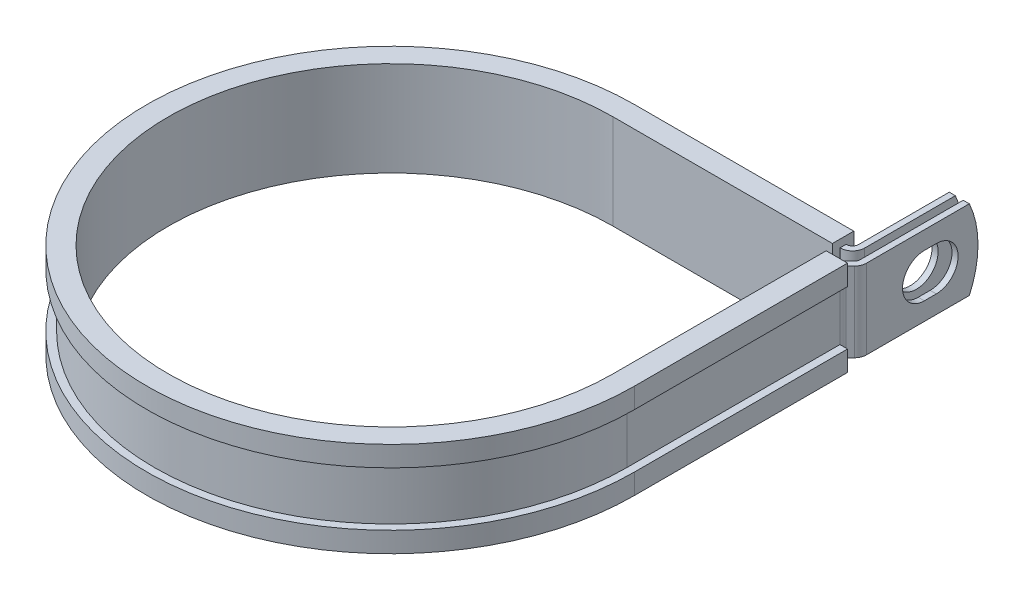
ISO-10303-21;
HEADER;
FILE_DESCRIPTION(('STEP AP214'),'2;1');
FILE_NAME('part.step','',(''),(''),'','','');
FILE_SCHEMA(('AUTOMOTIVE_DESIGN { 1 0 10303 214 1 1 1 1 }'));
ENDSEC;
DATA;
#1=APPLICATION_CONTEXT('core data for automotive mechanical design processes');
#2=APPLICATION_PROTOCOL_DEFINITION('international standard','automotive_design',2000,#1);
#3=PRODUCT_CONTEXT('',#1,'mechanical');
#4=PRODUCT('Part','Part','',(#3));
#5=PRODUCT_RELATED_PRODUCT_CATEGORY('part','',(#4));
#6=PRODUCT_DEFINITION_FORMATION('','',#4);
#7=PRODUCT_DEFINITION_CONTEXT('part definition',#1,'design');
#8=PRODUCT_DEFINITION('design','',#6,#7);
#9=PRODUCT_DEFINITION_SHAPE('','',#8);
#10=(LENGTH_UNIT() NAMED_UNIT(*) SI_UNIT(.MILLI.,.METRE.));
#11=(NAMED_UNIT(*) PLANE_ANGLE_UNIT() SI_UNIT($,.RADIAN.));
#12=(NAMED_UNIT(*) SI_UNIT($,.STERADIAN.) SOLID_ANGLE_UNIT());
#13=UNCERTAINTY_MEASURE_WITH_UNIT(LENGTH_MEASURE(1.E-05),#10,'distance_accuracy_value','');
#14=(GEOMETRIC_REPRESENTATION_CONTEXT(3) GLOBAL_UNCERTAINTY_ASSIGNED_CONTEXT((#13)) GLOBAL_UNIT_ASSIGNED_CONTEXT((#10,
#11,#12)) REPRESENTATION_CONTEXT('',''));
#15=CARTESIAN_POINT('',(0.,0.,0.));
#16=DIRECTION('',(0.,0.,1.));
#17=DIRECTION('',(1.,0.,0.));
#18=AXIS2_PLACEMENT_3D('',#15,#16,#17);
#19=CARTESIAN_POINT('',(46.6522698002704,-7.9375,-45.974));
#20=DIRECTION('',(0.,1.,0.));
#21=DIRECTION('',(1.,0.,0.));
#22=AXIS2_PLACEMENT_3D('',#19,#20,#21);
#23=PLANE('',#22);
#24=DIRECTION('',(0.,0.,-1.));
#25=VECTOR('',#24,1.);
#26=CARTESIAN_POINT('',(43.8074698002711,-7.9375,-45.974));
#27=LINE('',#26,#25);
#28=CARTESIAN_POINT('',(43.8074698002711,-7.9375,-45.974));
#29=VERTEX_POINT('',#28);
#30=CARTESIAN_POINT('',(43.8074698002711,-7.9375,-47.1932));
#31=VERTEX_POINT('',#30);
#32=EDGE_CURVE('E524',#29,#31,#27,.T.);
#33=ORIENTED_EDGE('',*,*,#32,.T.);
#34=DIRECTION('',(1.,0.,0.));
#35=VECTOR('',#34,1.);
#36=CARTESIAN_POINT('',(0.,-7.9375,-47.1932));
#37=LINE('',#36,#35);
#38=CARTESIAN_POINT('',(43.8582698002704,-7.9375,-47.1932));
#39=VERTEX_POINT('',#38);
#40=EDGE_CURVE('E411',#39,#31,#37,.F.);
#41=ORIENTED_EDGE('',*,*,#40,.F.);
#42=CARTESIAN_POINT('',(43.8582698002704,-7.9375,-48.4124));
#43=DIRECTION('',(0.,1.,0.));
#44=DIRECTION('',(1.,0.,0.));
#45=AXIS2_PLACEMENT_3D('',#42,#43,#44);
#46=CIRCLE('',#45,1.2192);
#47=CARTESIAN_POINT('',(45.0774698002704,-7.9375,-48.4124));
#48=VERTEX_POINT('',#47);
#49=EDGE_CURVE('E409',#48,#39,#46,.F.);
#50=ORIENTED_EDGE('',*,*,#49,.F.);
#51=DIRECTION('',(0.,0.,1.));
#52=VECTOR('',#51,1.);
#53=CARTESIAN_POINT('',(45.0774698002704,-7.9375,-68.2498));
#54=LINE('',#53,#52);
#55=CARTESIAN_POINT('',(45.0774698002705,-7.9375,-66.5173804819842));
#56=VERTEX_POINT('',#55);
#57=EDGE_CURVE('E407',#56,#48,#54,.T.);
#58=ORIENTED_EDGE('',*,*,#57,.F.);
#59=DIRECTION('',(-1.,0.,0.));
#60=VECTOR('',#59,1.);
#61=CARTESIAN_POINT('',(49.0906698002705,-7.9375,-66.5173804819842));
#62=LINE('',#61,#60);
#63=CARTESIAN_POINT('',(46.2966698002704,-7.9375,-66.5173804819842));
#64=VERTEX_POINT('',#63);
#65=EDGE_CURVE('E12',#64,#56,#62,.T.);
#66=ORIENTED_EDGE('',*,*,#65,.F.);
#67=DIRECTION('',(0.,0.,1.));
#68=VECTOR('',#67,1.);
#69=CARTESIAN_POINT('',(46.2966698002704,-7.9375,-68.2498));
#70=LINE('',#69,#68);
#71=CARTESIAN_POINT('',(46.2966698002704,-7.9375,-48.4124));
#72=VERTEX_POINT('',#71);
#73=EDGE_CURVE('E405',#64,#72,#70,.T.);
#74=ORIENTED_EDGE('',*,*,#73,.T.);
#75=CARTESIAN_POINT('',(43.8582698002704,-7.9375,-48.4124));
#76=DIRECTION('',(0.,-1.,0.));
#77=DIRECTION('',(0.,0.,1.));
#78=AXIS2_PLACEMENT_3D('',#75,#76,#77);
#79=CIRCLE('',#78,2.4384);
#80=CARTESIAN_POINT('',(43.8582698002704,-7.9375,-45.974));
#81=VERTEX_POINT('',#80);
#82=EDGE_CURVE('E402',#72,#81,#79,.T.);
#83=ORIENTED_EDGE('',*,*,#82,.T.);
#84=DIRECTION('',(-1.,0.,0.));
#85=VECTOR('',#84,1.);
#86=CARTESIAN_POINT('',(0.,-7.9375,-45.974));
#87=LINE('',#86,#85);
#88=EDGE_CURVE('E399',#81,#29,#87,.T.);
#89=ORIENTED_EDGE('',*,*,#88,.T.);
#90=EDGE_LOOP('',(#33,#41,#50,#58,#66,#74,#83,#89));
#91=FACE_BOUND('',#90,.T.);
#92=ADVANCED_FACE('F55',(#91),#23,.F.);
#93=CARTESIAN_POINT('',(46.6522698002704,7.9375,-45.974));
#94=DIRECTION('',(0.,1.,0.));
#95=DIRECTION('',(1.,0.,0.));
#96=AXIS2_PLACEMENT_3D('',#93,#94,#95);
#97=PLANE('',#96);
#98=DIRECTION('',(1.,0.,0.));
#99=VECTOR('',#98,1.);
#100=CARTESIAN_POINT('',(0.,7.9375,-47.1932));
#101=LINE('',#100,#99);
#102=CARTESIAN_POINT('',(43.8582698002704,7.9375,-47.1932));
#103=VERTEX_POINT('',#102);
#104=CARTESIAN_POINT('',(43.8074698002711,7.9375,-47.1932));
#105=VERTEX_POINT('',#104);
#106=EDGE_CURVE('E369',#103,#105,#101,.F.);
#107=ORIENTED_EDGE('',*,*,#106,.T.);
#108=DIRECTION('',(0.,0.,1.));
#109=VECTOR('',#108,1.);
#110=CARTESIAN_POINT('',(43.8074698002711,7.9375,-47.1932));
#111=LINE('',#110,#109);
#112=CARTESIAN_POINT('',(43.8074698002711,7.9375,-45.974));
#113=VERTEX_POINT('',#112);
#114=EDGE_CURVE('E518',#105,#113,#111,.T.);
#115=ORIENTED_EDGE('',*,*,#114,.T.);
#116=DIRECTION('',(-1.,0.,0.));
#117=VECTOR('',#116,1.);
#118=CARTESIAN_POINT('',(0.,7.9375,-45.974));
#119=LINE('',#118,#117);
#120=CARTESIAN_POINT('',(43.8582698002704,7.9375,-45.974));
#121=VERTEX_POINT('',#120);
#122=EDGE_CURVE('E626',#121,#113,#119,.T.);
#123=ORIENTED_EDGE('',*,*,#122,.F.);
#124=CARTESIAN_POINT('',(43.8582698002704,7.9375,-48.4124));
#125=DIRECTION('',(0.,-1.,0.));
#126=DIRECTION('',(0.,0.,1.));
#127=AXIS2_PLACEMENT_3D('',#124,#125,#126);
#128=CIRCLE('',#127,2.4384);
#129=CARTESIAN_POINT('',(46.2966698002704,7.9375,-48.4124));
#130=VERTEX_POINT('',#129);
#131=EDGE_CURVE('E371',#130,#121,#128,.T.);
#132=ORIENTED_EDGE('',*,*,#131,.F.);
#133=DIRECTION('',(0.,0.,1.));
#134=VECTOR('',#133,1.);
#135=CARTESIAN_POINT('',(46.2966698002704,7.9375,-68.2498));
#136=LINE('',#135,#134);
#137=CARTESIAN_POINT('',(46.2966698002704,7.9375,-66.5173804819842));
#138=VERTEX_POINT('',#137);
#139=EDGE_CURVE('E362',#138,#130,#136,.T.);
#140=ORIENTED_EDGE('',*,*,#139,.F.);
#141=DIRECTION('',(-1.,0.,0.));
#142=VECTOR('',#141,1.);
#143=CARTESIAN_POINT('',(49.0906698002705,7.9375,-66.5173804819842));
#144=LINE('',#143,#142);
#145=CARTESIAN_POINT('',(45.0774698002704,7.9375,-66.5173804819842));
#146=VERTEX_POINT('',#145);
#147=EDGE_CURVE('E63',#138,#146,#144,.T.);
#148=ORIENTED_EDGE('',*,*,#147,.T.);
#149=DIRECTION('',(0.,0.,1.));
#150=VECTOR('',#149,1.);
#151=CARTESIAN_POINT('',(45.0774698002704,7.9375,-68.2498));
#152=LINE('',#151,#150);
#153=CARTESIAN_POINT('',(45.0774698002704,7.9375,-48.4124));
#154=VERTEX_POINT('',#153);
#155=EDGE_CURVE('E359',#146,#154,#152,.T.);
#156=ORIENTED_EDGE('',*,*,#155,.T.);
#157=CARTESIAN_POINT('',(43.8582698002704,7.9375,-48.4124));
#158=DIRECTION('',(0.,1.,0.));
#159=DIRECTION('',(1.,0.,0.));
#160=AXIS2_PLACEMENT_3D('',#157,#158,#159);
#161=CIRCLE('',#160,1.2192);
#162=EDGE_CURVE('E367',#154,#103,#161,.F.);
#163=ORIENTED_EDGE('',*,*,#162,.T.);
#164=EDGE_LOOP('',(#107,#115,#123,#132,#140,#148,#156,#163));
#165=FACE_BOUND('',#164,.T.);
#166=ADVANCED_FACE('F358',(#165),#97,.T.);
#167=CARTESIAN_POINT('',(0.,7.9375,-45.974));
#168=DIRECTION('',(0.,0.,1.));
#169=DIRECTION('',(1.,0.,0.));
#170=AXIS2_PLACEMENT_3D('',#167,#168,#169);
#171=PLANE('',#170);
#172=ORIENTED_EDGE('',*,*,#122,.T.);
#173=DIRECTION('',(0.,-1.,0.));
#174=VECTOR('',#173,1.);
#175=CARTESIAN_POINT('',(43.8074698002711,7.9375,-45.974));
#176=LINE('',#175,#174);
#177=EDGE_CURVE('E521',#113,#29,#176,.T.);
#178=ORIENTED_EDGE('',*,*,#177,.T.);
#179=ORIENTED_EDGE('',*,*,#88,.F.);
#180=DIRECTION('',(0.,-1.,0.));
#181=VECTOR('',#180,1.);
#182=CARTESIAN_POINT('',(43.8582698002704,7.9375,-45.974));
#183=LINE('',#182,#181);
#184=EDGE_CURVE('E345',#121,#81,#183,.T.);
#185=ORIENTED_EDGE('',*,*,#184,.F.);
#186=EDGE_LOOP('',(#172,#178,#179,#185));
#187=FACE_BOUND('',#186,.T.);
#188=ADVANCED_FACE('F636',(#187),#171,.T.);
#189=CARTESIAN_POINT('',(49.0906698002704,7.9375,-45.974));
#190=DIRECTION('',(-1.,0.,0.));
#191=DIRECTION('',(0.,0.,1.));
#192=AXIS2_PLACEMENT_3D('',#189,#190,#191);
#193=PLANE('',#192);
#194=CARTESIAN_POINT('',(49.0906698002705,0.,-59.9185999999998));
#195=DIRECTION('',(1.,0.,0.));
#196=DIRECTION('',(0.,0.,-1.));
#197=AXIS2_PLACEMENT_3D('',#194,#195,#196);
#198=CIRCLE('',#197,4.3561);
#199=CARTESIAN_POINT('',(49.0906698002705,-4.3561,-59.9186000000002));
#200=VERTEX_POINT('',#199);
#201=CARTESIAN_POINT('',(49.0906698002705,4.3561,-59.9186000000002));
#202=VERTEX_POINT('',#201);
#203=EDGE_CURVE('E581',#200,#202,#198,.T.);
#204=ORIENTED_EDGE('',*,*,#203,.F.);
#205=DIRECTION('',(0.,0.,-1.));
#206=VECTOR('',#205,1.);
#207=CARTESIAN_POINT('',(49.0906698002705,-4.3561,-57.5309999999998));
#208=LINE('',#207,#206);
#209=CARTESIAN_POINT('',(49.0906698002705,-4.3561,-57.5309999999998));
#210=VERTEX_POINT('',#209);
#211=EDGE_CURVE('E584',#210,#200,#208,.T.);
#212=ORIENTED_EDGE('',*,*,#211,.F.);
#213=CARTESIAN_POINT('',(49.0906698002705,0.,-57.5309999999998));
#214=DIRECTION('',(1.,0.,0.));
#215=DIRECTION('',(0.,0.,-1.));
#216=AXIS2_PLACEMENT_3D('',#213,#214,#215);
#217=CIRCLE('',#216,4.3561);
#218=CARTESIAN_POINT('',(49.0906698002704,4.3561,-57.5309999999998));
#219=VERTEX_POINT('',#218);
#220=EDGE_CURVE('E577',#219,#210,#217,.T.);
#221=ORIENTED_EDGE('',*,*,#220,.F.);
#222=DIRECTION('',(0.,0.,1.));
#223=VECTOR('',#222,1.);
#224=CARTESIAN_POINT('',(49.0906698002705,4.3561,-57.5309999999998));
#225=LINE('',#224,#223);
#226=EDGE_CURVE('E578',#202,#219,#225,.T.);
#227=ORIENTED_EDGE('',*,*,#226,.F.);
#228=EDGE_LOOP('',(#204,#212,#221,#227));
#229=FACE_BOUND('',#228,.T.);
#230=DIRECTION('',(0.,0.,-1.));
#231=VECTOR('',#230,1.);
#232=CARTESIAN_POINT('',(49.0906698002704,-7.9375,-45.974));
#233=LINE('',#232,#231);
#234=CARTESIAN_POINT('',(49.0906698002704,-7.9375,-45.974));
#235=VERTEX_POINT('',#234);
#236=CARTESIAN_POINT('',(49.0906698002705,-7.9375,-66.5173804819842));
#237=VERTEX_POINT('',#236);
#238=EDGE_CURVE('E383',#235,#237,#233,.T.);
#239=ORIENTED_EDGE('',*,*,#238,.T.);
#240=CARTESIAN_POINT('',(49.0906698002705,0.,-49.1998));
#241=DIRECTION('',(-1.,0.,0.));
#242=DIRECTION('',(0.,0.,1.));
#243=AXIS2_PLACEMENT_3D('',#240,#241,#242);
#244=CIRCLE('',#243,19.05);
#245=CARTESIAN_POINT('',(49.0906698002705,7.9375,-66.5173804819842));
#246=VERTEX_POINT('',#245);
#247=EDGE_CURVE('E569',#246,#237,#244,.T.);
#248=ORIENTED_EDGE('',*,*,#247,.F.);
#249=DIRECTION('',(0.,0.,-1.));
#250=VECTOR('',#249,1.);
#251=CARTESIAN_POINT('',(49.0906698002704,7.9375,-45.974));
#252=LINE('',#251,#250);
#253=CARTESIAN_POINT('',(49.0906698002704,7.9375,-45.974));
#254=VERTEX_POINT('',#253);
#255=EDGE_CURVE('E420',#254,#246,#252,.T.);
#256=ORIENTED_EDGE('',*,*,#255,.F.);
#257=DIRECTION('',(0.,-1.,0.));
#258=VECTOR('',#257,1.);
#259=CARTESIAN_POINT('',(49.0906698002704,7.9375,-45.974));
#260=LINE('',#259,#258);
#261=EDGE_CURVE('E382',#254,#235,#260,.T.);
#262=ORIENTED_EDGE('',*,*,#261,.T.);
#263=EDGE_LOOP('',(#239,#248,#256,#262));
#264=FACE_BOUND('',#263,.T.);
#265=ADVANCED_FACE('F57',(#229,#264),#193,.F.);
#266=CARTESIAN_POINT('',(47.8714698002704,7.9375,-45.974));
#267=DIRECTION('',(-1.,0.,0.));
#268=DIRECTION('',(0.,0.,1.));
#269=AXIS2_PLACEMENT_3D('',#266,#267,#268);
#270=PLANE('',#269);
#271=DIRECTION('',(0.,0.,-1.));
#272=VECTOR('',#271,1.);
#273=CARTESIAN_POINT('',(47.8714698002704,-4.3561,-57.5309999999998));
#274=LINE('',#273,#272);
#275=CARTESIAN_POINT('',(47.8714698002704,-4.3561,-57.5309999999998));
#276=VERTEX_POINT('',#275);
#277=CARTESIAN_POINT('',(47.8714698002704,-4.3561,-59.9186000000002));
#278=VERTEX_POINT('',#277);
#279=EDGE_CURVE('E580',#276,#278,#274,.T.);
#280=ORIENTED_EDGE('',*,*,#279,.T.);
#281=CARTESIAN_POINT('',(47.8714698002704,0.,-59.9185999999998));
#282=DIRECTION('',(-1.,0.,0.));
#283=DIRECTION('',(0.,0.,1.));
#284=AXIS2_PLACEMENT_3D('',#281,#282,#283);
#285=CIRCLE('',#284,4.3561);
#286=CARTESIAN_POINT('',(47.8714698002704,4.3561,-59.9186000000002));
#287=VERTEX_POINT('',#286);
#288=EDGE_CURVE('E601',#278,#287,#285,.F.);
#289=ORIENTED_EDGE('',*,*,#288,.T.);
#290=DIRECTION('',(0.,0.,1.));
#291=VECTOR('',#290,1.);
#292=CARTESIAN_POINT('',(47.8714698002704,4.3561,-57.5309999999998));
#293=LINE('',#292,#291);
#294=CARTESIAN_POINT('',(47.8714698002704,4.3561,-57.5309999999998));
#295=VERTEX_POINT('',#294);
#296=EDGE_CURVE('E597',#287,#295,#293,.T.);
#297=ORIENTED_EDGE('',*,*,#296,.T.);
#298=CARTESIAN_POINT('',(47.8714698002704,0.,-57.5309999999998));
#299=DIRECTION('',(-1.,0.,0.));
#300=DIRECTION('',(0.,0.,1.));
#301=AXIS2_PLACEMENT_3D('',#298,#299,#300);
#302=CIRCLE('',#301,4.3561);
#303=EDGE_CURVE('E592',#295,#276,#302,.F.);
#304=ORIENTED_EDGE('',*,*,#303,.T.);
#305=EDGE_LOOP('',(#280,#289,#297,#304));
#306=FACE_BOUND('',#305,.T.);
#307=CARTESIAN_POINT('',(47.8714698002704,0.,-49.1998));
#308=DIRECTION('',(-1.,0.,0.));
#309=DIRECTION('',(0.,0.,1.));
#310=AXIS2_PLACEMENT_3D('',#307,#308,#309);
#311=CIRCLE('',#310,19.05);
#312=CARTESIAN_POINT('',(47.8714698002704,7.9375,-66.5173804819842));
#313=VERTEX_POINT('',#312);
#314=CARTESIAN_POINT('',(47.8714698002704,-7.9375,-66.5173804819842));
#315=VERTEX_POINT('',#314);
#316=EDGE_CURVE('E77',#313,#315,#311,.T.);
#317=ORIENTED_EDGE('',*,*,#316,.T.);
#318=DIRECTION('',(0.,0.,-1.));
#319=VECTOR('',#318,1.);
#320=CARTESIAN_POINT('',(47.8714698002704,-7.9375,-45.974));
#321=LINE('',#320,#319);
#322=CARTESIAN_POINT('',(47.8714698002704,-7.9375,-45.974));
#323=VERTEX_POINT('',#322);
#324=EDGE_CURVE('E386',#323,#315,#321,.T.);
#325=ORIENTED_EDGE('',*,*,#324,.F.);
#326=DIRECTION('',(0.,-1.,0.));
#327=VECTOR('',#326,1.);
#328=CARTESIAN_POINT('',(47.8714698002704,7.9375,-45.974));
#329=LINE('',#328,#327);
#330=CARTESIAN_POINT('',(47.8714698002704,7.9375,-45.974));
#331=VERTEX_POINT('',#330);
#332=EDGE_CURVE('E353',#331,#323,#329,.T.);
#333=ORIENTED_EDGE('',*,*,#332,.F.);
#334=DIRECTION('',(0.,0.,-1.));
#335=VECTOR('',#334,1.);
#336=CARTESIAN_POINT('',(47.8714698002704,7.9375,-45.974));
#337=LINE('',#336,#335);
#338=EDGE_CURVE('E616',#331,#313,#337,.T.);
#339=ORIENTED_EDGE('',*,*,#338,.T.);
#340=EDGE_LOOP('',(#317,#325,#333,#339));
#341=FACE_BOUND('',#340,.T.);
#342=ADVANCED_FACE('F690',(#306,#341),#270,.T.);
#343=CARTESIAN_POINT('',(46.2966698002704,7.9375,-68.2498));
#344=DIRECTION('',(1.,0.,0.));
#345=DIRECTION('',(0.,0.,-1.));
#346=AXIS2_PLACEMENT_3D('',#343,#344,#345);
#347=PLANE('',#346);
#348=CARTESIAN_POINT('',(46.2966698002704,0.,-58.7248));
#349=DIRECTION('',(1.,0.,0.));
#350=DIRECTION('',(0.,0.,-1.));
#351=AXIS2_PLACEMENT_3D('',#348,#349,#350);
#352=CIRCLE('',#351,4.3561);
#353=CARTESIAN_POINT('',(46.2966698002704,0.,-63.0809));
#354=VERTEX_POINT('',#353);
#355=EDGE_CURVE('E387',#354,#354,#352,.F.);
#356=ORIENTED_EDGE('',*,*,#355,.T.);
#357=EDGE_LOOP('',(#356));
#358=FACE_BOUND('',#357,.T.);
#359=ORIENTED_EDGE('',*,*,#73,.F.);
#360=CARTESIAN_POINT('',(46.2966698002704,0.,-49.1998));
#361=DIRECTION('',(1.,0.,0.));
#362=DIRECTION('',(0.,0.,-1.));
#363=AXIS2_PLACEMENT_3D('',#360,#361,#362);
#364=CIRCLE('',#363,19.05);
#365=EDGE_CURVE('E574',#64,#138,#364,.T.);
#366=ORIENTED_EDGE('',*,*,#365,.T.);
#367=ORIENTED_EDGE('',*,*,#139,.T.);
#368=DIRECTION('',(0.,-1.,0.));
#369=VECTOR('',#368,1.);
#370=CARTESIAN_POINT('',(46.2966698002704,7.9375,-48.4124));
#371=LINE('',#370,#369);
#372=EDGE_CURVE('E342',#130,#72,#371,.T.);
#373=ORIENTED_EDGE('',*,*,#372,.T.);
#374=EDGE_LOOP('',(#359,#366,#367,#373));
#375=FACE_BOUND('',#374,.T.);
#376=ADVANCED_FACE('F642',(#358,#375),#347,.T.);
#377=CARTESIAN_POINT('',(45.0774698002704,7.9375,-68.2498));
#378=DIRECTION('',(1.,0.,0.));
#379=DIRECTION('',(0.,0.,-1.));
#380=AXIS2_PLACEMENT_3D('',#377,#378,#379);
#381=PLANE('',#380);
#382=CARTESIAN_POINT('',(45.0774698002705,0.,-58.7248));
#383=DIRECTION('',(-1.,0.,0.));
#384=DIRECTION('',(0.,0.,1.));
#385=AXIS2_PLACEMENT_3D('',#382,#383,#384);
#386=CIRCLE('',#385,4.3561);
#387=CARTESIAN_POINT('',(45.0774698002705,0.,-54.3687));
#388=VERTEX_POINT('',#387);
#389=EDGE_CURVE('E609',#388,#388,#386,.T.);
#390=ORIENTED_EDGE('',*,*,#389,.F.);
#391=EDGE_LOOP('',(#390));
#392=FACE_BOUND('',#391,.T.);
#393=CARTESIAN_POINT('',(45.0774698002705,0.,-49.1998));
#394=DIRECTION('',(-1.,0.,0.));
#395=DIRECTION('',(0.,0.,1.));
#396=AXIS2_PLACEMENT_3D('',#393,#394,#395);
#397=CIRCLE('',#396,19.05);
#398=EDGE_CURVE('E69',#146,#56,#397,.T.);
#399=ORIENTED_EDGE('',*,*,#398,.T.);
#400=ORIENTED_EDGE('',*,*,#57,.T.);
#401=DIRECTION('',(0.,-1.,0.));
#402=VECTOR('',#401,1.);
#403=CARTESIAN_POINT('',(45.0774698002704,7.9375,-48.4124));
#404=LINE('',#403,#402);
#405=EDGE_CURVE('E339',#154,#48,#404,.T.);
#406=ORIENTED_EDGE('',*,*,#405,.F.);
#407=ORIENTED_EDGE('',*,*,#155,.F.);
#408=EDGE_LOOP('',(#399,#400,#406,#407));
#409=FACE_BOUND('',#408,.T.);
#410=ADVANCED_FACE('F365',(#392,#409),#381,.F.);
#411=CARTESIAN_POINT('',(48.4124,-7.9375,-42.5615026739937));
#412=DIRECTION('',(0.,1.,0.));
#413=DIRECTION('',(1.,0.,0.));
#414=AXIS2_PLACEMENT_3D('',#411,#412,#413);
#415=CIRCLE('',#414,1.2192);
#416=CARTESIAN_POINT('',(47.1932,-7.9375,-42.5615026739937));
#417=VERTEX_POINT('',#416);
#418=CARTESIAN_POINT('',(47.5502954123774,-7.9375,-43.4236072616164));
#419=VERTEX_POINT('',#418);
#420=EDGE_CURVE('E414',#417,#419,#415,.F.);
#421=ORIENTED_EDGE('',*,*,#420,.F.);
#422=DIRECTION('',(1.,0.,0.));
#423=VECTOR('',#422,1.);
#424=CARTESIAN_POINT('',(45.974,-7.9375,-42.5615026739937));
#425=LINE('',#424,#423);
#426=CARTESIAN_POINT('',(45.974,-7.9375,-42.5615026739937));
#427=VERTEX_POINT('',#426);
#428=EDGE_CURVE('E452',#427,#417,#425,.T.);
#429=ORIENTED_EDGE('',*,*,#428,.F.);
#430=CARTESIAN_POINT('',(48.4124,-7.9375,-42.5615026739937));
#431=DIRECTION('',(0.,-1.,0.));
#432=DIRECTION('',(0.,0.,1.));
#433=AXIS2_PLACEMENT_3D('',#430,#431,#432);
#434=CIRCLE('',#433,2.4384);
#435=CARTESIAN_POINT('',(46.6881908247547,-7.9375,-44.285711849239));
#436=VERTEX_POINT('',#435);
#437=EDGE_CURVE('E396',#427,#436,#434,.T.);
#438=ORIENTED_EDGE('',*,*,#437,.T.);
#439=DIRECTION('',(0.707106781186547,0.,-0.707106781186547));
#440=VECTOR('',#439,1.);
#441=CARTESIAN_POINT('',(46.6881908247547,-7.9375,-44.285711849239));
#442=LINE('',#441,#440);
#443=CARTESIAN_POINT('',(47.5143743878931,-7.9375,-45.1118954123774));
#444=VERTEX_POINT('',#443);
#445=EDGE_CURVE('E393',#436,#444,#442,.T.);
#446=ORIENTED_EDGE('',*,*,#445,.T.);
#447=CARTESIAN_POINT('',(46.6522698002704,-7.9375,-45.974));
#448=DIRECTION('',(0.,1.,0.));
#449=DIRECTION('',(0.,0.,1.));
#450=AXIS2_PLACEMENT_3D('',#447,#448,#449);
#451=CIRCLE('',#450,1.2192);
#452=EDGE_CURVE('E390',#444,#323,#451,.T.);
#453=ORIENTED_EDGE('',*,*,#452,.T.);
#454=ORIENTED_EDGE('',*,*,#324,.T.);
#455=DIRECTION('',(-1.,0.,0.));
#456=VECTOR('',#455,1.);
#457=CARTESIAN_POINT('',(49.0906698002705,-7.9375,-66.5173804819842));
#458=LINE('',#457,#456);
#459=EDGE_CURVE('E567',#237,#315,#458,.T.);
#460=ORIENTED_EDGE('',*,*,#459,.F.);
#461=ORIENTED_EDGE('',*,*,#238,.F.);
#462=CARTESIAN_POINT('',(46.6522698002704,-7.9375,-45.974));
#463=DIRECTION('',(0.,1.,0.));
#464=DIRECTION('',(1.,0.,0.));
#465=AXIS2_PLACEMENT_3D('',#462,#463,#464);
#466=CIRCLE('',#465,2.4384);
#467=CARTESIAN_POINT('',(48.3764789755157,-7.9375,-44.2497908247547));
#468=VERTEX_POINT('',#467);
#469=EDGE_CURVE('E418',#468,#235,#466,.T.);
#470=ORIENTED_EDGE('',*,*,#469,.F.);
#471=DIRECTION('',(0.707106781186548,0.,-0.707106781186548));
#472=VECTOR('',#471,1.);
#473=CARTESIAN_POINT('',(47.5502954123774,-7.9375,-43.4236072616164));
#474=LINE('',#473,#472);
#475=EDGE_CURVE('E416',#419,#468,#474,.T.);
#476=ORIENTED_EDGE('',*,*,#475,.F.);
#477=EDGE_LOOP('',(#421,#429,#438,#446,#453,#454,#460,#461,#470,#476));
#478=FACE_BOUND('',#477,.T.);
#479=ADVANCED_FACE('F676',(#478),#23,.F.);
#480=DIRECTION('',(-1.,0.,0.));
#481=VECTOR('',#480,1.);
#482=CARTESIAN_POINT('',(47.1932,7.9375,-42.5615026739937));
#483=LINE('',#482,#481);
#484=CARTESIAN_POINT('',(47.1932,7.9375,-42.5615026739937));
#485=VERTEX_POINT('',#484);
#486=CARTESIAN_POINT('',(45.974,7.9375,-42.5615026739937));
#487=VERTEX_POINT('',#486);
#488=EDGE_CURVE('E441',#485,#487,#483,.T.);
#489=ORIENTED_EDGE('',*,*,#488,.F.);
#490=CARTESIAN_POINT('',(48.4124,7.9375,-42.5615026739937));
#491=DIRECTION('',(0.,1.,0.));
#492=DIRECTION('',(1.,0.,0.));
#493=AXIS2_PLACEMENT_3D('',#490,#491,#492);
#494=CIRCLE('',#493,1.2192);
#495=CARTESIAN_POINT('',(47.5502954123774,7.9375,-43.4236072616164));
#496=VERTEX_POINT('',#495);
#497=EDGE_CURVE('E376',#485,#496,#494,.F.);
#498=ORIENTED_EDGE('',*,*,#497,.T.);
#499=DIRECTION('',(0.707106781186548,0.,-0.707106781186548));
#500=VECTOR('',#499,1.);
#501=CARTESIAN_POINT('',(47.5502954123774,7.9375,-43.4236072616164));
#502=LINE('',#501,#500);
#503=CARTESIAN_POINT('',(48.3764789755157,7.9375,-44.2497908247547));
#504=VERTEX_POINT('',#503);
#505=EDGE_CURVE('E378',#496,#504,#502,.T.);
#506=ORIENTED_EDGE('',*,*,#505,.T.);
#507=CARTESIAN_POINT('',(46.6522698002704,7.9375,-45.974));
#508=DIRECTION('',(0.,1.,0.));
#509=DIRECTION('',(1.,0.,0.));
#510=AXIS2_PLACEMENT_3D('',#507,#508,#509);
#511=CIRCLE('',#510,2.4384);
#512=EDGE_CURVE('E380',#504,#254,#511,.T.);
#513=ORIENTED_EDGE('',*,*,#512,.T.);
#514=ORIENTED_EDGE('',*,*,#255,.T.);
#515=DIRECTION('',(-1.,0.,0.));
#516=VECTOR('',#515,1.);
#517=CARTESIAN_POINT('',(49.0906698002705,7.9375,-66.5173804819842));
#518=LINE('',#517,#516);
#519=EDGE_CURVE('E571',#246,#313,#518,.T.);
#520=ORIENTED_EDGE('',*,*,#519,.T.);
#521=ORIENTED_EDGE('',*,*,#338,.F.);
#522=CARTESIAN_POINT('',(46.6522698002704,7.9375,-45.974));
#523=DIRECTION('',(0.,1.,0.));
#524=DIRECTION('',(0.,0.,1.));
#525=AXIS2_PLACEMENT_3D('',#522,#523,#524);
#526=CIRCLE('',#525,1.2192);
#527=CARTESIAN_POINT('',(47.5143743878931,7.9375,-45.1118954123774));
#528=VERTEX_POINT('',#527);
#529=EDGE_CURVE('E619',#528,#331,#526,.T.);
#530=ORIENTED_EDGE('',*,*,#529,.F.);
#531=DIRECTION('',(0.707106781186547,0.,-0.707106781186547));
#532=VECTOR('',#531,1.);
#533=CARTESIAN_POINT('',(46.6881908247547,7.9375,-44.285711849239));
#534=LINE('',#533,#532);
#535=CARTESIAN_POINT('',(46.6881908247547,7.9375,-44.285711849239));
#536=VERTEX_POINT('',#535);
#537=EDGE_CURVE('E622',#536,#528,#534,.T.);
#538=ORIENTED_EDGE('',*,*,#537,.F.);
#539=CARTESIAN_POINT('',(48.4124,7.9375,-42.5615026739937));
#540=DIRECTION('',(0.,-1.,0.));
#541=DIRECTION('',(0.,0.,1.));
#542=AXIS2_PLACEMENT_3D('',#539,#540,#541);
#543=CIRCLE('',#542,2.4384);
#544=EDGE_CURVE('E451',#487,#536,#543,.T.);
#545=ORIENTED_EDGE('',*,*,#544,.F.);
#546=EDGE_LOOP('',(#489,#498,#506,#513,#514,#520,#521,#530,#538,#545));
#547=FACE_BOUND('',#546,.T.);
#548=ADVANCED_FACE('F448',(#547),#97,.T.);
#549=CARTESIAN_POINT('',(46.6522698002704,7.9375,-45.974));
#550=DIRECTION('',(0.,-1.,0.));
#551=DIRECTION('',(0.,0.,-1.));
#552=AXIS2_PLACEMENT_3D('',#549,#550,#551);
#553=CYLINDRICAL_SURFACE('',#552,1.2192);
#554=ORIENTED_EDGE('',*,*,#452,.F.);
#555=DIRECTION('',(0.,-1.,0.));
#556=VECTOR('',#555,1.);
#557=CARTESIAN_POINT('',(47.5143743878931,7.9375,-45.1118954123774));
#558=LINE('',#557,#556);
#559=EDGE_CURVE('E351',#528,#444,#558,.T.);
#560=ORIENTED_EDGE('',*,*,#559,.F.);
#561=ORIENTED_EDGE('',*,*,#529,.T.);
#562=ORIENTED_EDGE('',*,*,#332,.T.);
#563=EDGE_LOOP('',(#554,#560,#561,#562));
#564=FACE_BOUND('',#563,.T.);
#565=ADVANCED_FACE('F686',(#564),#553,.F.);
#566=CARTESIAN_POINT('',(46.6881908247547,7.9375,-44.285711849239));
#567=DIRECTION('',(-0.707106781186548,0.,-0.707106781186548));
#568=DIRECTION('',(-0.707106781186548,0.,0.707106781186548));
#569=AXIS2_PLACEMENT_3D('',#566,#567,#568);
#570=PLANE('',#569);
#571=ORIENTED_EDGE('',*,*,#445,.F.);
#572=DIRECTION('',(0.,-1.,0.));
#573=VECTOR('',#572,1.);
#574=CARTESIAN_POINT('',(46.6881908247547,7.9375,-44.285711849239));
#575=LINE('',#574,#573);
#576=EDGE_CURVE('E349',#536,#436,#575,.T.);
#577=ORIENTED_EDGE('',*,*,#576,.F.);
#578=ORIENTED_EDGE('',*,*,#537,.T.);
#579=ORIENTED_EDGE('',*,*,#559,.T.);
#580=EDGE_LOOP('',(#571,#577,#578,#579));
#581=FACE_BOUND('',#580,.T.);
#582=ADVANCED_FACE('F681',(#581),#570,.T.);
#583=CARTESIAN_POINT('',(48.4124,7.9375,-42.5615026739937));
#584=DIRECTION('',(0.,-1.,0.));
#585=DIRECTION('',(0.,0.,-1.));
#586=AXIS2_PLACEMENT_3D('',#583,#584,#585);
#587=CYLINDRICAL_SURFACE('',#586,2.4384);
#588=ORIENTED_EDGE('',*,*,#437,.F.);
#589=DIRECTION('',(0.,-1.,0.));
#590=VECTOR('',#589,1.);
#591=CARTESIAN_POINT('',(45.974,7.9375,-42.5615026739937));
#592=LINE('',#591,#590);
#593=EDGE_CURVE('E347',#487,#427,#592,.T.);
#594=ORIENTED_EDGE('',*,*,#593,.F.);
#595=ORIENTED_EDGE('',*,*,#544,.T.);
#596=ORIENTED_EDGE('',*,*,#576,.T.);
#597=EDGE_LOOP('',(#588,#594,#595,#596));
#598=FACE_BOUND('',#597,.T.);
#599=ADVANCED_FACE('F678',(#598),#587,.T.);
#600=CARTESIAN_POINT('',(43.8582698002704,7.9375,-48.4124));
#601=DIRECTION('',(0.,-1.,0.));
#602=DIRECTION('',(0.,0.,-1.));
#603=AXIS2_PLACEMENT_3D('',#600,#601,#602);
#604=CYLINDRICAL_SURFACE('',#603,2.4384);
#605=ORIENTED_EDGE('',*,*,#82,.F.);
#606=ORIENTED_EDGE('',*,*,#372,.F.);
#607=ORIENTED_EDGE('',*,*,#131,.T.);
#608=ORIENTED_EDGE('',*,*,#184,.T.);
#609=EDGE_LOOP('',(#605,#606,#607,#608));
#610=FACE_BOUND('',#609,.T.);
#611=ADVANCED_FACE('F632',(#610),#604,.T.);
#612=CARTESIAN_POINT('',(43.8582698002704,7.9375,-48.4124));
#613=DIRECTION('',(0.,-1.,0.));
#614=DIRECTION('',(0.,0.,-1.));
#615=AXIS2_PLACEMENT_3D('',#612,#613,#614);
#616=CYLINDRICAL_SURFACE('',#615,1.2192);
#617=ORIENTED_EDGE('',*,*,#49,.T.);
#618=DIRECTION('',(0.,-1.,0.));
#619=VECTOR('',#618,1.);
#620=CARTESIAN_POINT('',(43.8582698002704,7.9375,-47.1932));
#621=LINE('',#620,#619);
#622=EDGE_CURVE('E330',#103,#39,#621,.T.);
#623=ORIENTED_EDGE('',*,*,#622,.F.);
#624=ORIENTED_EDGE('',*,*,#162,.F.);
#625=ORIENTED_EDGE('',*,*,#405,.T.);
#626=EDGE_LOOP('',(#617,#623,#624,#625));
#627=FACE_BOUND('',#626,.T.);
#628=ADVANCED_FACE('F647',(#627),#616,.F.);
#629=CARTESIAN_POINT('',(0.,7.9375,-47.1932));
#630=DIRECTION('',(0.,0.,1.));
#631=DIRECTION('',(1.,0.,0.));
#632=AXIS2_PLACEMENT_3D('',#629,#630,#631);
#633=PLANE('',#632);
#634=DIRECTION('',(0.,-1.,0.));
#635=VECTOR('',#634,1.);
#636=CARTESIAN_POINT('',(0.,7.9375,-47.1932));
#637=LINE('',#636,#635);
#638=CARTESIAN_POINT('',(6.61986458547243E-13,5.3975,-47.1932));
#639=VERTEX_POINT('',#638);
#640=CARTESIAN_POINT('',(6.61986458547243E-13,-5.3975,-47.1932));
#641=VERTEX_POINT('',#640);
#642=EDGE_CURVE('E321',#639,#641,#637,.T.);
#643=ORIENTED_EDGE('',*,*,#642,.F.);
#644=DIRECTION('',(1.,0.,0.));
#645=VECTOR('',#644,1.);
#646=CARTESIAN_POINT('',(6.61986458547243E-13,5.3975,-47.1932));
#647=LINE('',#646,#645);
#648=CARTESIAN_POINT('',(43.8074698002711,5.3975,-47.1932));
#649=VERTEX_POINT('',#648);
#650=EDGE_CURVE('E564',#639,#649,#647,.T.);
#651=ORIENTED_EDGE('',*,*,#650,.T.);
#652=DIRECTION('',(0.,1.,0.));
#653=VECTOR('',#652,1.);
#654=CARTESIAN_POINT('',(43.8074698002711,7.9375,-47.1932));
#655=LINE('',#654,#653);
#656=EDGE_CURVE('E515',#649,#105,#655,.T.);
#657=ORIENTED_EDGE('',*,*,#656,.T.);
#658=ORIENTED_EDGE('',*,*,#106,.F.);
#659=ORIENTED_EDGE('',*,*,#622,.T.);
#660=ORIENTED_EDGE('',*,*,#40,.T.);
#661=DIRECTION('',(0.,1.,0.));
#662=VECTOR('',#661,1.);
#663=CARTESIAN_POINT('',(43.8074698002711,-7.9375,-47.1932));
#664=LINE('',#663,#662);
#665=CARTESIAN_POINT('',(43.8074698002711,-5.3975,-47.1932));
#666=VERTEX_POINT('',#665);
#667=EDGE_CURVE('E527',#31,#666,#664,.T.);
#668=ORIENTED_EDGE('',*,*,#667,.T.);
#669=DIRECTION('',(1.,0.,0.));
#670=VECTOR('',#669,1.);
#671=CARTESIAN_POINT('',(6.61986458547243E-13,-5.3975,-47.1932));
#672=LINE('',#671,#670);
#673=EDGE_CURVE('E544',#641,#666,#672,.T.);
#674=ORIENTED_EDGE('',*,*,#673,.F.);
#675=EDGE_LOOP('',(#643,#651,#657,#658,#659,#660,#668,#674));
#676=FACE_BOUND('',#675,.T.);
#677=ADVANCED_FACE('F651',(#676),#633,.F.);
#678=CARTESIAN_POINT('',(0.,7.9375,0.));
#679=DIRECTION('',(0.,-1.,0.));
#680=DIRECTION('',(0.,0.,-1.));
#681=AXIS2_PLACEMENT_3D('',#678,#679,#680);
#682=CYLINDRICAL_SURFACE('',#681,47.1932);
#683=DIRECTION('',(0.,-1.,0.));
#684=VECTOR('',#683,1.);
#685=CARTESIAN_POINT('',(47.1932,7.9375,0.));
#686=LINE('',#685,#684);
#687=CARTESIAN_POINT('',(47.1932,5.3975,0.));
#688=VERTEX_POINT('',#687);
#689=CARTESIAN_POINT('',(47.1932,-5.3975,0.));
#690=VERTEX_POINT('',#689);
#691=EDGE_CURVE('E319',#688,#690,#686,.T.);
#692=ORIENTED_EDGE('',*,*,#691,.F.);
#693=CARTESIAN_POINT('',(0.,5.3975,0.));
#694=DIRECTION('',(0.,-1.,0.));
#695=DIRECTION('',(0.,0.,-1.));
#696=AXIS2_PLACEMENT_3D('',#693,#694,#695);
#697=CIRCLE('',#696,47.1932);
#698=EDGE_CURVE('E513',#688,#639,#697,.T.);
#699=ORIENTED_EDGE('',*,*,#698,.T.);
#700=ORIENTED_EDGE('',*,*,#642,.T.);
#701=CARTESIAN_POINT('',(0.,-5.3975,0.));
#702=DIRECTION('',(0.,-1.,0.));
#703=DIRECTION('',(0.,0.,-1.));
#704=AXIS2_PLACEMENT_3D('',#701,#702,#703);
#705=CIRCLE('',#704,47.1932);
#706=EDGE_CURVE('E302',#690,#641,#705,.T.);
#707=ORIENTED_EDGE('',*,*,#706,.F.);
#708=EDGE_LOOP('',(#692,#699,#700,#707));
#709=FACE_BOUND('',#708,.T.);
#710=ADVANCED_FACE('F317',(#709),#682,.T.);
#711=CARTESIAN_POINT('',(47.1932,7.9375,0.));
#712=DIRECTION('',(-1.,0.,0.));
#713=DIRECTION('',(0.,0.,1.));
#714=AXIS2_PLACEMENT_3D('',#711,#712,#713);
#715=PLANE('',#714);
#716=DIRECTION('',(0.,-1.,0.));
#717=VECTOR('',#716,1.);
#718=CARTESIAN_POINT('',(47.1932,7.9375,-42.5615026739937));
#719=LINE('',#718,#717);
#720=CARTESIAN_POINT('',(47.1932,5.3975,-42.5615026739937));
#721=VERTEX_POINT('',#720);
#722=CARTESIAN_POINT('',(47.1932,-5.3975,-42.5615026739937));
#723=VERTEX_POINT('',#722);
#724=EDGE_CURVE('E333',#721,#723,#719,.T.);
#725=ORIENTED_EDGE('',*,*,#724,.F.);
#726=DIRECTION('',(0.,0.,-1.));
#727=VECTOR('',#726,1.);
#728=CARTESIAN_POINT('',(47.1932,5.3975,0.));
#729=LINE('',#728,#727);
#730=EDGE_CURVE('E327',#688,#721,#729,.T.);
#731=ORIENTED_EDGE('',*,*,#730,.F.);
#732=ORIENTED_EDGE('',*,*,#691,.T.);
#733=DIRECTION('',(0.,0.,-1.));
#734=VECTOR('',#733,1.);
#735=CARTESIAN_POINT('',(47.1932,-5.3975,0.));
#736=LINE('',#735,#734);
#737=EDGE_CURVE('E298',#690,#723,#736,.T.);
#738=ORIENTED_EDGE('',*,*,#737,.T.);
#739=EDGE_LOOP('',(#725,#731,#732,#738));
#740=FACE_BOUND('',#739,.T.);
#741=ADVANCED_FACE('F326',(#740),#715,.F.);
#742=CARTESIAN_POINT('',(48.4124,7.9375,-42.5615026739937));
#743=DIRECTION('',(0.,-1.,0.));
#744=DIRECTION('',(0.,0.,-1.));
#745=AXIS2_PLACEMENT_3D('',#742,#743,#744);
#746=CYLINDRICAL_SURFACE('',#745,1.2192);
#747=ORIENTED_EDGE('',*,*,#420,.T.);
#748=DIRECTION('',(0.,-1.,0.));
#749=VECTOR('',#748,1.);
#750=CARTESIAN_POINT('',(47.5502954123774,7.9375,-43.4236072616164));
#751=LINE('',#750,#749);
#752=EDGE_CURVE('E425',#496,#419,#751,.T.);
#753=ORIENTED_EDGE('',*,*,#752,.F.);
#754=ORIENTED_EDGE('',*,*,#497,.F.);
#755=EDGE_CURVE('E328',#485,#721,#719,.T.);
#756=ORIENTED_EDGE('',*,*,#755,.T.);
#757=ORIENTED_EDGE('',*,*,#724,.T.);
#758=DIRECTION('',(0.,1.,0.));
#759=VECTOR('',#758,1.);
#760=CARTESIAN_POINT('',(47.1932,-7.9375,-42.5615026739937));
#761=LINE('',#760,#759);
#762=EDGE_CURVE('E434',#417,#723,#761,.T.);
#763=ORIENTED_EDGE('',*,*,#762,.F.);
#764=EDGE_LOOP('',(#747,#753,#754,#756,#757,#763));
#765=FACE_BOUND('',#764,.T.);
#766=ADVANCED_FACE('F433',(#765),#746,.F.);
#767=CARTESIAN_POINT('',(47.5502954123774,7.9375,-43.4236072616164));
#768=DIRECTION('',(-0.707106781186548,0.,-0.707106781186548));
#769=DIRECTION('',(-0.707106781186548,0.,0.707106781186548));
#770=AXIS2_PLACEMENT_3D('',#767,#768,#769);
#771=PLANE('',#770);
#772=ORIENTED_EDGE('',*,*,#475,.T.);
#773=DIRECTION('',(0.,-1.,0.));
#774=VECTOR('',#773,1.);
#775=CARTESIAN_POINT('',(48.3764789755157,7.9375,-44.2497908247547));
#776=LINE('',#775,#774);
#777=EDGE_CURVE('E423',#504,#468,#776,.T.);
#778=ORIENTED_EDGE('',*,*,#777,.F.);
#779=ORIENTED_EDGE('',*,*,#505,.F.);
#780=ORIENTED_EDGE('',*,*,#752,.T.);
#781=EDGE_LOOP('',(#772,#778,#779,#780));
#782=FACE_BOUND('',#781,.T.);
#783=ADVANCED_FACE('F702',(#782),#771,.F.);
#784=CARTESIAN_POINT('',(46.6522698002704,7.9375,-45.974));
#785=DIRECTION('',(0.,-1.,0.));
#786=DIRECTION('',(0.,0.,-1.));
#787=AXIS2_PLACEMENT_3D('',#784,#785,#786);
#788=CYLINDRICAL_SURFACE('',#787,2.4384);
#789=ORIENTED_EDGE('',*,*,#469,.T.);
#790=ORIENTED_EDGE('',*,*,#261,.F.);
#791=ORIENTED_EDGE('',*,*,#512,.F.);
#792=ORIENTED_EDGE('',*,*,#777,.T.);
#793=EDGE_LOOP('',(#789,#790,#791,#792));
#794=FACE_BOUND('',#793,.T.);
#795=ADVANCED_FACE('F700',(#794),#788,.T.);
#796=CARTESIAN_POINT('',(58.6175811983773,0.,-58.7248));
#797=DIRECTION('',(-1.,0.,0.));
#798=DIRECTION('',(0.,0.,1.));
#799=AXIS2_PLACEMENT_3D('',#796,#797,#798);
#800=CYLINDRICAL_SURFACE('',#799,4.3561);
#801=ORIENTED_EDGE('',*,*,#389,.T.);
#802=EDGE_LOOP('',(#801));
#803=FACE_BOUND('',#802,.T.);
#804=ORIENTED_EDGE('',*,*,#355,.F.);
#805=EDGE_LOOP('',(#804));
#806=FACE_BOUND('',#805,.T.);
#807=ADVANCED_FACE('F709',(#803,#806),#800,.F.);
#808=CARTESIAN_POINT('',(33.7609067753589,-4.3561,-57.5309999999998));
#809=DIRECTION('',(0.,-1.,0.));
#810=DIRECTION('',(0.,0.,-1.));
#811=AXIS2_PLACEMENT_3D('',#808,#809,#810);
#812=PLANE('',#811);
#813=DIRECTION('',(1.,0.,0.));
#814=VECTOR('',#813,1.);
#815=CARTESIAN_POINT('',(33.7609067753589,-4.3561,-57.5309999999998));
#816=LINE('',#815,#814);
#817=EDGE_CURVE('E595',#276,#210,#816,.T.);
#818=ORIENTED_EDGE('',*,*,#817,.T.);
#819=ORIENTED_EDGE('',*,*,#211,.T.);
#820=DIRECTION('',(1.,0.,0.));
#821=VECTOR('',#820,1.);
#822=CARTESIAN_POINT('',(33.7609067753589,-4.3561,-59.9186000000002));
#823=LINE('',#822,#821);
#824=EDGE_CURVE('E591',#278,#200,#823,.T.);
#825=ORIENTED_EDGE('',*,*,#824,.F.);
#826=ORIENTED_EDGE('',*,*,#279,.F.);
#827=EDGE_LOOP('',(#818,#819,#825,#826));
#828=FACE_BOUND('',#827,.T.);
#829=ADVANCED_FACE('F752',(#828),#812,.F.);
#830=CARTESIAN_POINT('',(33.7609067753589,0.,-59.9185999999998));
#831=DIRECTION('',(1.,0.,0.));
#832=DIRECTION('',(0.,0.,-1.));
#833=AXIS2_PLACEMENT_3D('',#830,#831,#832);
#834=CYLINDRICAL_SURFACE('',#833,4.3561);
#835=ORIENTED_EDGE('',*,*,#824,.T.);
#836=ORIENTED_EDGE('',*,*,#203,.T.);
#837=DIRECTION('',(1.,0.,0.));
#838=VECTOR('',#837,1.);
#839=CARTESIAN_POINT('',(33.7609067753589,4.3561,-59.9186000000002));
#840=LINE('',#839,#838);
#841=EDGE_CURVE('E600',#287,#202,#840,.T.);
#842=ORIENTED_EDGE('',*,*,#841,.F.);
#843=ORIENTED_EDGE('',*,*,#288,.F.);
#844=EDGE_LOOP('',(#835,#836,#842,#843));
#845=FACE_BOUND('',#844,.T.);
#846=ADVANCED_FACE('F756',(#845),#834,.F.);
#847=CARTESIAN_POINT('',(33.7609067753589,4.3561,-57.5309999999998));
#848=DIRECTION('',(0.,1.,0.));
#849=DIRECTION('',(0.,0.,1.));
#850=AXIS2_PLACEMENT_3D('',#847,#848,#849);
#851=PLANE('',#850);
#852=ORIENTED_EDGE('',*,*,#841,.T.);
#853=ORIENTED_EDGE('',*,*,#226,.T.);
#854=DIRECTION('',(1.,0.,0.));
#855=VECTOR('',#854,1.);
#856=CARTESIAN_POINT('',(33.7609067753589,4.3561,-57.5309999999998));
#857=LINE('',#856,#855);
#858=EDGE_CURVE('E596',#295,#219,#857,.T.);
#859=ORIENTED_EDGE('',*,*,#858,.F.);
#860=ORIENTED_EDGE('',*,*,#296,.F.);
#861=EDGE_LOOP('',(#852,#853,#859,#860));
#862=FACE_BOUND('',#861,.T.);
#863=ADVANCED_FACE('F760',(#862),#851,.F.);
#864=CARTESIAN_POINT('',(33.7609067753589,0.,-57.5309999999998));
#865=DIRECTION('',(1.,0.,0.));
#866=DIRECTION('',(0.,0.,-1.));
#867=AXIS2_PLACEMENT_3D('',#864,#865,#866);
#868=CYLINDRICAL_SURFACE('',#867,4.3561);
#869=ORIENTED_EDGE('',*,*,#858,.T.);
#870=ORIENTED_EDGE('',*,*,#220,.T.);
#871=ORIENTED_EDGE('',*,*,#817,.F.);
#872=ORIENTED_EDGE('',*,*,#303,.F.);
#873=EDGE_LOOP('',(#869,#870,#871,#872));
#874=FACE_BOUND('',#873,.T.);
#875=ADVANCED_FACE('F764',(#874),#868,.F.);
#876=CARTESIAN_POINT('',(49.0906698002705,0.,-49.1998));
#877=DIRECTION('',(-1.,0.,0.));
#878=DIRECTION('',(0.,0.,1.));
#879=AXIS2_PLACEMENT_3D('',#876,#877,#878);
#880=CYLINDRICAL_SURFACE('',#879,19.05);
#881=ORIENTED_EDGE('',*,*,#365,.F.);
#882=ORIENTED_EDGE('',*,*,#65,.T.);
#883=ORIENTED_EDGE('',*,*,#398,.F.);
#884=ORIENTED_EDGE('',*,*,#147,.F.);
#885=EDGE_LOOP('',(#881,#882,#883,#884));
#886=FACE_BOUND('',#885,.T.);
#887=ADVANCED_FACE('F643',(#886),#880,.T.);
#888=ORIENTED_EDGE('',*,*,#519,.F.);
#889=ORIENTED_EDGE('',*,*,#247,.T.);
#890=ORIENTED_EDGE('',*,*,#459,.T.);
#891=ORIENTED_EDGE('',*,*,#316,.F.);
#892=EDGE_LOOP('',(#888,#889,#890,#891));
#893=FACE_BOUND('',#892,.T.);
#894=ADVANCED_FACE('F691',(#893),#880,.T.);
#895=CARTESIAN_POINT('',(6.83363846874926E-13,9.4615,-48.7172));
#896=DIRECTION('',(0.,0.,1.));
#897=DIRECTION('',(1.,0.,0.));
#898=AXIS2_PLACEMENT_3D('',#895,#896,#897);
#899=PLANE('',#898);
#900=DIRECTION('',(0.,-1.,0.));
#901=VECTOR('',#900,1.);
#902=CARTESIAN_POINT('',(6.83363846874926E-13,9.4615,-48.7172));
#903=LINE('',#902,#901);
#904=CARTESIAN_POINT('',(6.83363846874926E-13,9.4615,-48.7172));
#905=VERTEX_POINT('',#904);
#906=CARTESIAN_POINT('',(6.83363846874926E-13,5.3975,-48.7172));
#907=VERTEX_POINT('',#906);
#908=EDGE_CURVE('E323',#905,#907,#903,.T.);
#909=ORIENTED_EDGE('',*,*,#908,.F.);
#910=DIRECTION('',(1.,0.,0.));
#911=VECTOR('',#910,1.);
#912=CARTESIAN_POINT('',(6.83363846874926E-13,9.4615,-48.7172));
#913=LINE('',#912,#911);
#914=CARTESIAN_POINT('',(43.8074698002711,9.4615,-48.7172));
#915=VERTEX_POINT('',#914);
#916=EDGE_CURVE('E558',#905,#915,#913,.T.);
#917=ORIENTED_EDGE('',*,*,#916,.T.);
#918=DIRECTION('',(0.,-1.,0.));
#919=VECTOR('',#918,1.);
#920=CARTESIAN_POINT('',(43.8074698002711,9.4615,-48.7172));
#921=LINE('',#920,#919);
#922=CARTESIAN_POINT('',(43.8074698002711,5.3975,-48.7172));
#923=VERTEX_POINT('',#922);
#924=EDGE_CURVE('E540',#915,#923,#921,.T.);
#925=ORIENTED_EDGE('',*,*,#924,.T.);
#926=DIRECTION('',(1.,0.,0.));
#927=VECTOR('',#926,1.);
#928=CARTESIAN_POINT('',(6.83363846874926E-13,5.3975,-48.7172));
#929=LINE('',#928,#927);
#930=EDGE_CURVE('E561',#907,#923,#929,.T.);
#931=ORIENTED_EDGE('',*,*,#930,.F.);
#932=EDGE_LOOP('',(#909,#917,#925,#931));
#933=FACE_BOUND('',#932,.T.);
#934=ADVANCED_FACE('F855',(#933),#899,.F.);
#935=CARTESIAN_POINT('',(6.23507159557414E-13,9.4615,-44.45));
#936=DIRECTION('',(0.,0.,-1.));
#937=DIRECTION('',(-1.,0.,0.));
#938=AXIS2_PLACEMENT_3D('',#935,#936,#937);
#939=PLANE('',#938);
#940=DIRECTION('',(0.,1.,0.));
#941=VECTOR('',#940,1.);
#942=CARTESIAN_POINT('',(6.23507159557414E-13,9.4615,-44.45));
#943=LINE('',#942,#941);
#944=CARTESIAN_POINT('',(6.23507159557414E-13,-9.4615,-44.45));
#945=VERTEX_POINT('',#944);
#946=CARTESIAN_POINT('',(6.23507159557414E-13,9.4615,-44.45));
#947=VERTEX_POINT('',#946);
#948=EDGE_CURVE('E491',#945,#947,#943,.T.);
#949=ORIENTED_EDGE('',*,*,#948,.F.);
#950=DIRECTION('',(1.,0.,0.));
#951=VECTOR('',#950,1.);
#952=CARTESIAN_POINT('',(6.23507159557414E-13,-9.4615,-44.45));
#953=LINE('',#952,#951);
#954=CARTESIAN_POINT('',(43.8074698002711,-9.4615,-44.45));
#955=VERTEX_POINT('',#954);
#956=EDGE_CURVE('E552',#945,#955,#953,.T.);
#957=ORIENTED_EDGE('',*,*,#956,.T.);
#958=DIRECTION('',(0.,1.,0.));
#959=VECTOR('',#958,1.);
#960=CARTESIAN_POINT('',(43.8074698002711,9.4615,-44.45));
#961=LINE('',#960,#959);
#962=CARTESIAN_POINT('',(43.8074698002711,9.4615,-44.45));
#963=VERTEX_POINT('',#962);
#964=EDGE_CURVE('E536',#955,#963,#961,.T.);
#965=ORIENTED_EDGE('',*,*,#964,.T.);
#966=DIRECTION('',(1.,0.,0.));
#967=VECTOR('',#966,1.);
#968=CARTESIAN_POINT('',(6.23507159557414E-13,9.4615,-44.45));
#969=LINE('',#968,#967);
#970=EDGE_CURVE('E555',#947,#963,#969,.T.);
#971=ORIENTED_EDGE('',*,*,#970,.F.);
#972=EDGE_LOOP('',(#949,#957,#965,#971));
#973=FACE_BOUND('',#972,.T.);
#974=ADVANCED_FACE('F941',(#973),#939,.F.);
#975=CARTESIAN_POINT('',(6.83363846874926E-13,-9.4615,-48.7172));
#976=DIRECTION('',(0.,0.,1.));
#977=DIRECTION('',(1.,0.,0.));
#978=AXIS2_PLACEMENT_3D('',#975,#976,#977);
#979=PLANE('',#978);
#980=DIRECTION('',(0.,-1.,0.));
#981=VECTOR('',#980,1.);
#982=CARTESIAN_POINT('',(6.83363846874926E-13,-9.4615,-48.7172));
#983=LINE('',#982,#981);
#984=CARTESIAN_POINT('',(6.83363846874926E-13,-5.3975,-48.7172));
#985=VERTEX_POINT('',#984);
#986=CARTESIAN_POINT('',(6.83363846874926E-13,-9.4615,-48.7172));
#987=VERTEX_POINT('',#986);
#988=EDGE_CURVE('E477',#985,#987,#983,.T.);
#989=ORIENTED_EDGE('',*,*,#988,.F.);
#990=DIRECTION('',(1.,0.,0.));
#991=VECTOR('',#990,1.);
#992=CARTESIAN_POINT('',(6.83363846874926E-13,-5.3975,-48.7172));
#993=LINE('',#992,#991);
#994=CARTESIAN_POINT('',(43.8074698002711,-5.3975,-48.7172));
#995=VERTEX_POINT('',#994);
#996=EDGE_CURVE('E546',#985,#995,#993,.T.);
#997=ORIENTED_EDGE('',*,*,#996,.T.);
#998=DIRECTION('',(0.,-1.,0.));
#999=VECTOR('',#998,1.);
#1000=CARTESIAN_POINT('',(43.8074698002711,-9.4615,-48.7172));
#1001=LINE('',#1000,#999);
#1002=CARTESIAN_POINT('',(43.8074698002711,-9.4615,-48.7172));
#1003=VERTEX_POINT('',#1002);
#1004=EDGE_CURVE('E532',#995,#1003,#1001,.T.);
#1005=ORIENTED_EDGE('',*,*,#1004,.T.);
#1006=DIRECTION('',(1.,0.,0.));
#1007=VECTOR('',#1006,1.);
#1008=CARTESIAN_POINT('',(6.83363846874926E-13,-9.4615,-48.7172));
#1009=LINE('',#1008,#1007);
#1010=EDGE_CURVE('E549',#987,#1003,#1009,.T.);
#1011=ORIENTED_EDGE('',*,*,#1010,.F.);
#1012=EDGE_LOOP('',(#989,#997,#1005,#1011));
#1013=FACE_BOUND('',#1012,.T.);
#1014=ADVANCED_FACE('F662',(#1013),#979,.F.);
#1015=CARTESIAN_POINT('',(0.,7.9375,0.));
#1016=DIRECTION('',(0.,-1.,0.));
#1017=DIRECTION('',(0.,0.,-1.));
#1018=AXIS2_PLACEMENT_3D('',#1015,#1016,#1017);
#1019=CYLINDRICAL_SURFACE('',#1018,48.7172);
#1020=DIRECTION('',(0.,-1.,0.));
#1021=VECTOR('',#1020,1.);
#1022=CARTESIAN_POINT('',(48.7172,9.4615,0.));
#1023=LINE('',#1022,#1021);
#1024=CARTESIAN_POINT('',(48.7172,9.4615,0.));
#1025=VERTEX_POINT('',#1024);
#1026=CARTESIAN_POINT('',(48.7172,5.3975,0.));
#1027=VERTEX_POINT('',#1026);
#1028=EDGE_CURVE('E312',#1025,#1027,#1023,.T.);
#1029=ORIENTED_EDGE('',*,*,#1028,.F.);
#1030=CARTESIAN_POINT('',(0.,9.4615,0.));
#1031=DIRECTION('',(0.,-1.,0.));
#1032=DIRECTION('',(0.,0.,-1.));
#1033=AXIS2_PLACEMENT_3D('',#1030,#1031,#1032);
#1034=CIRCLE('',#1033,48.7172);
#1035=EDGE_CURVE('E507',#1025,#905,#1034,.T.);
#1036=ORIENTED_EDGE('',*,*,#1035,.T.);
#1037=ORIENTED_EDGE('',*,*,#908,.T.);
#1038=CARTESIAN_POINT('',(0.,5.3975,0.));
#1039=DIRECTION('',(0.,-1.,0.));
#1040=DIRECTION('',(0.,0.,-1.));
#1041=AXIS2_PLACEMENT_3D('',#1038,#1039,#1040);
#1042=CIRCLE('',#1041,48.7172);
#1043=EDGE_CURVE('E510',#1027,#907,#1042,.T.);
#1044=ORIENTED_EDGE('',*,*,#1043,.F.);
#1045=EDGE_LOOP('',(#1029,#1036,#1037,#1044));
#1046=FACE_BOUND('',#1045,.T.);
#1047=ADVANCED_FACE('F961',(#1046),#1019,.T.);
#1048=CARTESIAN_POINT('',(0.,7.9375,0.));
#1049=DIRECTION('',(0.,-1.,0.));
#1050=DIRECTION('',(0.,0.,-1.));
#1051=AXIS2_PLACEMENT_3D('',#1048,#1049,#1050);
#1052=CYLINDRICAL_SURFACE('',#1051,44.45);
#1053=DIRECTION('',(0.,1.,0.));
#1054=VECTOR('',#1053,1.);
#1055=CARTESIAN_POINT('',(44.45,9.4615,0.));
#1056=LINE('',#1055,#1054);
#1057=CARTESIAN_POINT('',(44.45,-9.4615,0.));
#1058=VERTEX_POINT('',#1057);
#1059=CARTESIAN_POINT('',(44.45,9.4615,0.));
#1060=VERTEX_POINT('',#1059);
#1061=EDGE_CURVE('E1124',#1058,#1060,#1056,.T.);
#1062=ORIENTED_EDGE('',*,*,#1061,.F.);
#1063=CARTESIAN_POINT('',(0.,-9.4615,0.));
#1064=DIRECTION('',(0.,-1.,0.));
#1065=DIRECTION('',(0.,0.,-1.));
#1066=AXIS2_PLACEMENT_3D('',#1063,#1064,#1065);
#1067=CIRCLE('',#1066,44.45);
#1068=EDGE_CURVE('E501',#1058,#945,#1067,.T.);
#1069=ORIENTED_EDGE('',*,*,#1068,.T.);
#1070=ORIENTED_EDGE('',*,*,#948,.T.);
#1071=CARTESIAN_POINT('',(0.,9.4615,0.));
#1072=DIRECTION('',(0.,-1.,0.));
#1073=DIRECTION('',(0.,0.,-1.));
#1074=AXIS2_PLACEMENT_3D('',#1071,#1072,#1073);
#1075=CIRCLE('',#1074,44.45);
#1076=EDGE_CURVE('E504',#1060,#947,#1075,.T.);
#1077=ORIENTED_EDGE('',*,*,#1076,.F.);
#1078=EDGE_LOOP('',(#1062,#1069,#1070,#1077));
#1079=FACE_BOUND('',#1078,.T.);
#1080=ADVANCED_FACE('F971',(#1079),#1052,.F.);
#1081=CARTESIAN_POINT('',(0.,7.9375,0.));
#1082=DIRECTION('',(0.,-1.,0.));
#1083=DIRECTION('',(0.,0.,-1.));
#1084=AXIS2_PLACEMENT_3D('',#1081,#1082,#1083);
#1085=CYLINDRICAL_SURFACE('',#1084,48.7172);
#1086=DIRECTION('',(0.,-1.,0.));
#1087=VECTOR('',#1086,1.);
#1088=CARTESIAN_POINT('',(48.7172,-9.4615,0.));
#1089=LINE('',#1088,#1087);
#1090=CARTESIAN_POINT('',(48.7172,-5.3975,0.));
#1091=VERTEX_POINT('',#1090);
#1092=CARTESIAN_POINT('',(48.7172,-9.4615,0.));
#1093=VERTEX_POINT('',#1092);
#1094=EDGE_CURVE('E475',#1091,#1093,#1089,.T.);
#1095=ORIENTED_EDGE('',*,*,#1094,.F.);
#1096=CARTESIAN_POINT('',(0.,-5.3975,0.));
#1097=DIRECTION('',(0.,-1.,0.));
#1098=DIRECTION('',(0.,0.,-1.));
#1099=AXIS2_PLACEMENT_3D('',#1096,#1097,#1098);
#1100=CIRCLE('',#1099,48.7172);
#1101=EDGE_CURVE('E322',#1091,#985,#1100,.T.);
#1102=ORIENTED_EDGE('',*,*,#1101,.T.);
#1103=ORIENTED_EDGE('',*,*,#988,.T.);
#1104=CARTESIAN_POINT('',(0.,-9.4615,0.));
#1105=DIRECTION('',(0.,-1.,0.));
#1106=DIRECTION('',(0.,0.,-1.));
#1107=AXIS2_PLACEMENT_3D('',#1104,#1105,#1106);
#1108=CIRCLE('',#1107,48.7172);
#1109=EDGE_CURVE('E498',#1093,#987,#1108,.T.);
#1110=ORIENTED_EDGE('',*,*,#1109,.F.);
#1111=EDGE_LOOP('',(#1095,#1102,#1103,#1110));
#1112=FACE_BOUND('',#1111,.T.);
#1113=ADVANCED_FACE('F665',(#1112),#1085,.T.);
#1114=CARTESIAN_POINT('',(48.7172,5.3975,0.));
#1115=DIRECTION('',(0.,-1.,0.));
#1116=DIRECTION('',(0.,0.,-1.));
#1117=AXIS2_PLACEMENT_3D('',#1114,#1115,#1116);
#1118=PLANE('',#1117);
#1119=DIRECTION('',(-1.,0.,0.));
#1120=VECTOR('',#1119,1.);
#1121=CARTESIAN_POINT('',(48.7172,5.3975,-42.5615026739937));
#1122=LINE('',#1121,#1120);
#1123=CARTESIAN_POINT('',(48.7172,5.3975,-42.5615026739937));
#1124=VERTEX_POINT('',#1123);
#1125=EDGE_CURVE('E445',#1124,#721,#1122,.T.);
#1126=ORIENTED_EDGE('',*,*,#1125,.F.);
#1127=DIRECTION('',(0.,0.,-1.));
#1128=VECTOR('',#1127,1.);
#1129=CARTESIAN_POINT('',(48.7172,5.3975,0.));
#1130=LINE('',#1129,#1128);
#1131=EDGE_CURVE('E478',#1027,#1124,#1130,.T.);
#1132=ORIENTED_EDGE('',*,*,#1131,.F.);
#1133=ORIENTED_EDGE('',*,*,#1043,.T.);
#1134=ORIENTED_EDGE('',*,*,#930,.T.);
#1135=DIRECTION('',(0.,0.,1.));
#1136=VECTOR('',#1135,1.);
#1137=CARTESIAN_POINT('',(43.8074698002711,5.3975,-48.7172));
#1138=LINE('',#1137,#1136);
#1139=EDGE_CURVE('E542',#923,#649,#1138,.T.);
#1140=ORIENTED_EDGE('',*,*,#1139,.T.);
#1141=ORIENTED_EDGE('',*,*,#650,.F.);
#1142=ORIENTED_EDGE('',*,*,#698,.F.);
#1143=ORIENTED_EDGE('',*,*,#730,.T.);
#1144=EDGE_LOOP('',(#1126,#1132,#1133,#1134,#1140,#1141,#1142,#1143));
#1145=FACE_BOUND('',#1144,.T.);
#1146=ADVANCED_FACE('F992',(#1145),#1118,.T.);
#1147=CARTESIAN_POINT('',(48.7172,9.4615,0.));
#1148=DIRECTION('',(1.,0.,0.));
#1149=DIRECTION('',(0.,0.,-1.));
#1150=AXIS2_PLACEMENT_3D('',#1147,#1148,#1149);
#1151=PLANE('',#1150);
#1152=DIRECTION('',(0.,-1.,0.));
#1153=VECTOR('',#1152,1.);
#1154=CARTESIAN_POINT('',(48.7172,9.4615,-42.5615026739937));
#1155=LINE('',#1154,#1153);
#1156=CARTESIAN_POINT('',(48.7172,9.4615,-42.5615026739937));
#1157=VERTEX_POINT('',#1156);
#1158=EDGE_CURVE('E472',#1157,#1124,#1155,.T.);
#1159=ORIENTED_EDGE('',*,*,#1158,.F.);
#1160=DIRECTION('',(0.,0.,-1.));
#1161=VECTOR('',#1160,1.);
#1162=CARTESIAN_POINT('',(48.7172,9.4615,0.));
#1163=LINE('',#1162,#1161);
#1164=EDGE_CURVE('E480',#1025,#1157,#1163,.T.);
#1165=ORIENTED_EDGE('',*,*,#1164,.F.);
#1166=ORIENTED_EDGE('',*,*,#1028,.T.);
#1167=ORIENTED_EDGE('',*,*,#1131,.T.);
#1168=EDGE_LOOP('',(#1159,#1165,#1166,#1167));
#1169=FACE_BOUND('',#1168,.T.);
#1170=ADVANCED_FACE('F1003',(#1169),#1151,.T.);
#1171=CARTESIAN_POINT('',(48.7172,9.4615,0.));
#1172=DIRECTION('',(0.,1.,0.));
#1173=DIRECTION('',(0.,0.,1.));
#1174=AXIS2_PLACEMENT_3D('',#1171,#1172,#1173);
#1175=PLANE('',#1174);
#1176=DIRECTION('',(1.,0.,0.));
#1177=VECTOR('',#1176,1.);
#1178=CARTESIAN_POINT('',(48.7172,9.4615,-42.5615026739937));
#1179=LINE('',#1178,#1177);
#1180=CARTESIAN_POINT('',(44.45,9.4615,-42.5615026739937));
#1181=VERTEX_POINT('',#1180);
#1182=EDGE_CURVE('E469',#1181,#1157,#1179,.T.);
#1183=ORIENTED_EDGE('',*,*,#1182,.F.);
#1184=DIRECTION('',(0.,0.,-1.));
#1185=VECTOR('',#1184,1.);
#1186=CARTESIAN_POINT('',(44.45,9.4615,0.));
#1187=LINE('',#1186,#1185);
#1188=EDGE_CURVE('E482',#1060,#1181,#1187,.T.);
#1189=ORIENTED_EDGE('',*,*,#1188,.F.);
#1190=ORIENTED_EDGE('',*,*,#1076,.T.);
#1191=ORIENTED_EDGE('',*,*,#970,.T.);
#1192=DIRECTION('',(0.,0.,-1.));
#1193=VECTOR('',#1192,1.);
#1194=CARTESIAN_POINT('',(43.8074698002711,9.4615,-48.7172));
#1195=LINE('',#1194,#1193);
#1196=EDGE_CURVE('E538',#963,#915,#1195,.T.);
#1197=ORIENTED_EDGE('',*,*,#1196,.T.);
#1198=ORIENTED_EDGE('',*,*,#916,.F.);
#1199=ORIENTED_EDGE('',*,*,#1035,.F.);
#1200=ORIENTED_EDGE('',*,*,#1164,.T.);
#1201=EDGE_LOOP('',(#1183,#1189,#1190,#1191,#1197,#1198,#1199,#1200));
#1202=FACE_BOUND('',#1201,.T.);
#1203=ADVANCED_FACE('F1015',(#1202),#1175,.T.);
#1204=CARTESIAN_POINT('',(44.45,9.4615,0.));
#1205=DIRECTION('',(-1.,0.,0.));
#1206=DIRECTION('',(0.,0.,1.));
#1207=AXIS2_PLACEMENT_3D('',#1204,#1205,#1206);
#1208=PLANE('',#1207);
#1209=DIRECTION('',(0.,1.,0.));
#1210=VECTOR('',#1209,1.);
#1211=CARTESIAN_POINT('',(44.45,9.4615,-42.5615026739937));
#1212=LINE('',#1211,#1210);
#1213=CARTESIAN_POINT('',(44.45,-9.4615,-42.5615026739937));
#1214=VERTEX_POINT('',#1213);
#1215=EDGE_CURVE('E466',#1214,#1181,#1212,.T.);
#1216=ORIENTED_EDGE('',*,*,#1215,.F.);
#1217=DIRECTION('',(0.,0.,-1.));
#1218=VECTOR('',#1217,1.);
#1219=CARTESIAN_POINT('',(44.45,-9.4615,0.));
#1220=LINE('',#1219,#1218);
#1221=EDGE_CURVE('E484',#1058,#1214,#1220,.T.);
#1222=ORIENTED_EDGE('',*,*,#1221,.F.);
#1223=ORIENTED_EDGE('',*,*,#1061,.T.);
#1224=ORIENTED_EDGE('',*,*,#1188,.T.);
#1225=EDGE_LOOP('',(#1216,#1222,#1223,#1224));
#1226=FACE_BOUND('',#1225,.T.);
#1227=ADVANCED_FACE('F1027',(#1226),#1208,.T.);
#1228=CARTESIAN_POINT('',(44.45,-9.4615,0.));
#1229=DIRECTION('',(0.,-1.,0.));
#1230=DIRECTION('',(0.,0.,-1.));
#1231=AXIS2_PLACEMENT_3D('',#1228,#1229,#1230);
#1232=PLANE('',#1231);
#1233=DIRECTION('',(-1.,0.,0.));
#1234=VECTOR('',#1233,1.);
#1235=CARTESIAN_POINT('',(44.45,-9.4615,-42.5615026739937));
#1236=LINE('',#1235,#1234);
#1237=CARTESIAN_POINT('',(48.7172,-9.4615,-42.5615026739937));
#1238=VERTEX_POINT('',#1237);
#1239=EDGE_CURVE('E463',#1238,#1214,#1236,.T.);
#1240=ORIENTED_EDGE('',*,*,#1239,.F.);
#1241=DIRECTION('',(0.,0.,-1.));
#1242=VECTOR('',#1241,1.);
#1243=CARTESIAN_POINT('',(48.7172,-9.4615,0.));
#1244=LINE('',#1243,#1242);
#1245=EDGE_CURVE('E486',#1093,#1238,#1244,.T.);
#1246=ORIENTED_EDGE('',*,*,#1245,.F.);
#1247=ORIENTED_EDGE('',*,*,#1109,.T.);
#1248=ORIENTED_EDGE('',*,*,#1010,.T.);
#1249=DIRECTION('',(0.,0.,1.));
#1250=VECTOR('',#1249,1.);
#1251=CARTESIAN_POINT('',(43.8074698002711,-9.4615,-44.45));
#1252=LINE('',#1251,#1250);
#1253=EDGE_CURVE('E534',#1003,#955,#1252,.T.);
#1254=ORIENTED_EDGE('',*,*,#1253,.T.);
#1255=ORIENTED_EDGE('',*,*,#956,.F.);
#1256=ORIENTED_EDGE('',*,*,#1068,.F.);
#1257=ORIENTED_EDGE('',*,*,#1221,.T.);
#1258=EDGE_LOOP('',(#1240,#1246,#1247,#1248,#1254,#1255,#1256,#1257));
#1259=FACE_BOUND('',#1258,.T.);
#1260=ADVANCED_FACE('F1039',(#1259),#1232,.T.);
#1261=CARTESIAN_POINT('',(48.7172,-9.4615,0.));
#1262=DIRECTION('',(1.,0.,0.));
#1263=DIRECTION('',(0.,0.,-1.));
#1264=AXIS2_PLACEMENT_3D('',#1261,#1262,#1263);
#1265=PLANE('',#1264);
#1266=DIRECTION('',(0.,-1.,0.));
#1267=VECTOR('',#1266,1.);
#1268=CARTESIAN_POINT('',(48.7172,-9.4615,-42.5615026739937));
#1269=LINE('',#1268,#1267);
#1270=CARTESIAN_POINT('',(48.7172,-5.3975,-42.5615026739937));
#1271=VERTEX_POINT('',#1270);
#1272=EDGE_CURVE('E460',#1271,#1238,#1269,.T.);
#1273=ORIENTED_EDGE('',*,*,#1272,.F.);
#1274=DIRECTION('',(0.,0.,-1.));
#1275=VECTOR('',#1274,1.);
#1276=CARTESIAN_POINT('',(48.7172,-5.3975,0.));
#1277=LINE('',#1276,#1275);
#1278=EDGE_CURVE('E311',#1091,#1271,#1277,.T.);
#1279=ORIENTED_EDGE('',*,*,#1278,.F.);
#1280=ORIENTED_EDGE('',*,*,#1094,.T.);
#1281=ORIENTED_EDGE('',*,*,#1245,.T.);
#1282=EDGE_LOOP('',(#1273,#1279,#1280,#1281));
#1283=FACE_BOUND('',#1282,.T.);
#1284=ADVANCED_FACE('F670',(#1283),#1265,.T.);
#1285=CARTESIAN_POINT('',(47.1932,-5.3975,0.));
#1286=DIRECTION('',(0.,1.,0.));
#1287=DIRECTION('',(0.,0.,1.));
#1288=AXIS2_PLACEMENT_3D('',#1285,#1286,#1287);
#1289=PLANE('',#1288);
#1290=DIRECTION('',(1.,0.,0.));
#1291=VECTOR('',#1290,1.);
#1292=CARTESIAN_POINT('',(47.1932,-5.3975,-42.5615026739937));
#1293=LINE('',#1292,#1291);
#1294=EDGE_CURVE('E305',#723,#1271,#1293,.T.);
#1295=ORIENTED_EDGE('',*,*,#1294,.F.);
#1296=ORIENTED_EDGE('',*,*,#737,.F.);
#1297=ORIENTED_EDGE('',*,*,#706,.T.);
#1298=ORIENTED_EDGE('',*,*,#673,.T.);
#1299=DIRECTION('',(0.,0.,-1.));
#1300=VECTOR('',#1299,1.);
#1301=CARTESIAN_POINT('',(43.8074698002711,-5.3975,-47.1932));
#1302=LINE('',#1301,#1300);
#1303=EDGE_CURVE('E530',#666,#995,#1302,.T.);
#1304=ORIENTED_EDGE('',*,*,#1303,.T.);
#1305=ORIENTED_EDGE('',*,*,#996,.F.);
#1306=ORIENTED_EDGE('',*,*,#1101,.F.);
#1307=ORIENTED_EDGE('',*,*,#1278,.T.);
#1308=EDGE_LOOP('',(#1295,#1296,#1297,#1298,#1304,#1305,#1306,#1307));
#1309=FACE_BOUND('',#1308,.T.);
#1310=ADVANCED_FACE('F300',(#1309),#1289,.T.);
#1311=CARTESIAN_POINT('',(43.8074698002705,0.,0.));
#1312=DIRECTION('',(-1.,0.,0.));
#1313=DIRECTION('',(0.,0.,1.));
#1314=AXIS2_PLACEMENT_3D('',#1311,#1312,#1313);
#1315=PLANE('',#1314);
#1316=ORIENTED_EDGE('',*,*,#656,.F.);
#1317=ORIENTED_EDGE('',*,*,#1139,.F.);
#1318=ORIENTED_EDGE('',*,*,#924,.F.);
#1319=ORIENTED_EDGE('',*,*,#1196,.F.);
#1320=ORIENTED_EDGE('',*,*,#964,.F.);
#1321=ORIENTED_EDGE('',*,*,#1253,.F.);
#1322=ORIENTED_EDGE('',*,*,#1004,.F.);
#1323=ORIENTED_EDGE('',*,*,#1303,.F.);
#1324=ORIENTED_EDGE('',*,*,#667,.F.);
#1325=ORIENTED_EDGE('',*,*,#32,.F.);
#1326=ORIENTED_EDGE('',*,*,#177,.F.);
#1327=ORIENTED_EDGE('',*,*,#114,.F.);
#1328=EDGE_LOOP('',(#1316,#1317,#1318,#1319,#1320,#1321,#1322,#1323,#1324,#1325,#1326,#1327));
#1329=FACE_BOUND('',#1328,.T.);
#1330=ADVANCED_FACE('F655',(#1329),#1315,.F.);
#1331=CARTESIAN_POINT('',(0.,0.,-42.5615026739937));
#1332=DIRECTION('',(0.,0.,-1.));
#1333=DIRECTION('',(-1.,0.,0.));
#1334=AXIS2_PLACEMENT_3D('',#1331,#1332,#1333);
#1335=PLANE('',#1334);
#1336=ORIENTED_EDGE('',*,*,#755,.F.);
#1337=ORIENTED_EDGE('',*,*,#488,.T.);
#1338=ORIENTED_EDGE('',*,*,#593,.T.);
#1339=ORIENTED_EDGE('',*,*,#428,.T.);
#1340=ORIENTED_EDGE('',*,*,#762,.T.);
#1341=ORIENTED_EDGE('',*,*,#1294,.T.);
#1342=ORIENTED_EDGE('',*,*,#1272,.T.);
#1343=ORIENTED_EDGE('',*,*,#1239,.T.);
#1344=ORIENTED_EDGE('',*,*,#1215,.T.);
#1345=ORIENTED_EDGE('',*,*,#1182,.T.);
#1346=ORIENTED_EDGE('',*,*,#1158,.T.);
#1347=ORIENTED_EDGE('',*,*,#1125,.T.);
#1348=EDGE_LOOP('',(#1336,#1337,#1338,#1339,#1340,#1341,#1342,#1343,#1344,#1345,#1346,#1347));
#1349=FACE_BOUND('',#1348,.T.);
#1350=ADVANCED_FACE('F440',(#1349),#1335,.T.);
#1351=CLOSED_SHELL('',(#92,#166,#188,#265,#342,#376,#410,#479,#548,#565,#582,#599,#611,#628,
#677,#710,#741,#766,#783,#795,#807,#829,#846,#863,#875,#887,#894,#934,#974,#1014,#1047,#1080,
#1113,#1146,#1170,#1203,#1227,#1260,#1284,#1310,#1330,#1350));
#1352=MANIFOLD_SOLID_BREP('B2',#1351);
#1353=ADVANCED_BREP_SHAPE_REPRESENTATION('',(#18,#1352),#14);
#1354=SHAPE_DEFINITION_REPRESENTATION(#9,#1353);
ENDSEC;
END-ISO-10303-21;
